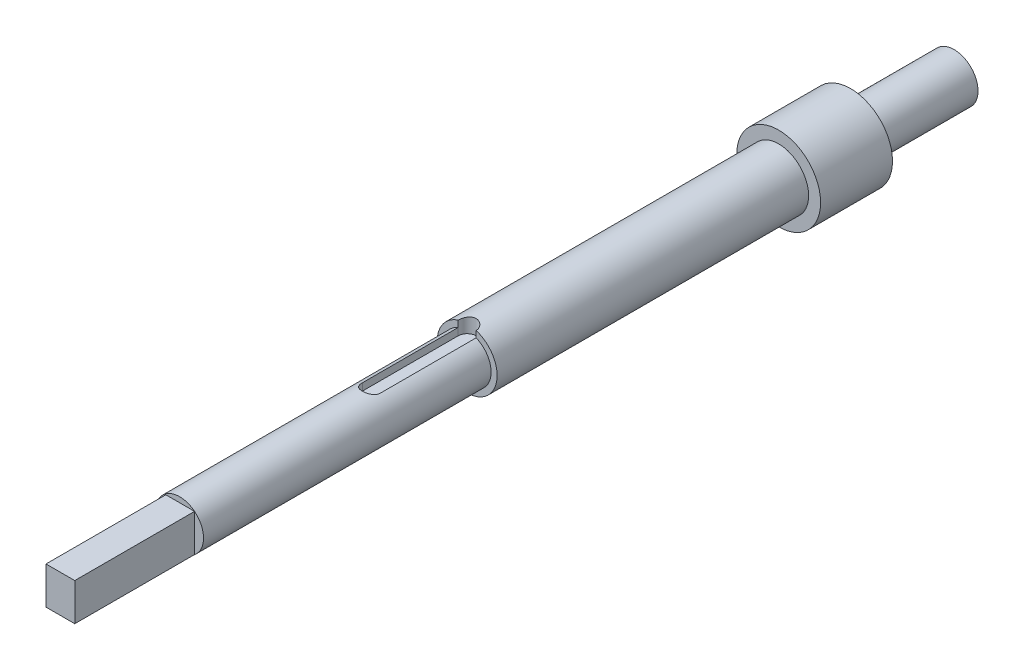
ISO-10303-21;
HEADER;
FILE_DESCRIPTION(('STEP AP214'),'2;1');
FILE_NAME('part.step','',(''),(''),'','','');
FILE_SCHEMA(('AUTOMOTIVE_DESIGN { 1 0 10303 214 1 1 1 1 }'));
ENDSEC;
DATA;
#1=APPLICATION_CONTEXT('core data for automotive mechanical design processes');
#2=APPLICATION_PROTOCOL_DEFINITION('international standard','automotive_design',2000,#1);
#3=PRODUCT_CONTEXT('',#1,'mechanical');
#4=PRODUCT('Part','Part','',(#3));
#5=PRODUCT_RELATED_PRODUCT_CATEGORY('part','',(#4));
#6=PRODUCT_DEFINITION_FORMATION('','',#4);
#7=PRODUCT_DEFINITION_CONTEXT('part definition',#1,'design');
#8=PRODUCT_DEFINITION('design','',#6,#7);
#9=PRODUCT_DEFINITION_SHAPE('','',#8);
#10=(LENGTH_UNIT() NAMED_UNIT(*) SI_UNIT(.MILLI.,.METRE.));
#11=(NAMED_UNIT(*) PLANE_ANGLE_UNIT() SI_UNIT($,.RADIAN.));
#12=(NAMED_UNIT(*) SI_UNIT($,.STERADIAN.) SOLID_ANGLE_UNIT());
#13=UNCERTAINTY_MEASURE_WITH_UNIT(LENGTH_MEASURE(1.E-05),#10,'distance_accuracy_value','');
#14=(GEOMETRIC_REPRESENTATION_CONTEXT(3) GLOBAL_UNCERTAINTY_ASSIGNED_CONTEXT((#13)) GLOBAL_UNIT_ASSIGNED_CONTEXT((#10,
#11,#12)) REPRESENTATION_CONTEXT('',''));
#15=CARTESIAN_POINT('',(0.,0.,0.));
#16=DIRECTION('',(0.,0.,1.));
#17=DIRECTION('',(1.,0.,0.));
#18=AXIS2_PLACEMENT_3D('',#15,#16,#17);
#19=CARTESIAN_POINT('',(0.,0.,76.2));
#20=DIRECTION('',(0.,0.,-1.));
#21=DIRECTION('',(-1.,0.,0.));
#22=AXIS2_PLACEMENT_3D('',#19,#20,#21);
#23=CYLINDRICAL_SURFACE('',#22,6.35);
#24=CARTESIAN_POINT('',(0.,0.,76.2));
#25=DIRECTION('',(0.,0.,1.));
#26=DIRECTION('',(1.,0.,0.));
#27=AXIS2_PLACEMENT_3D('',#24,#25,#26);
#28=CIRCLE('',#27,6.35);
#29=CARTESIAN_POINT('',(3.96875,4.95696716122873,76.2));
#30=VERTEX_POINT('',#29);
#31=CARTESIAN_POINT('',(3.96875,-4.95696716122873,76.2));
#32=VERTEX_POINT('',#31);
#33=EDGE_CURVE('E213',#30,#32,#28,.T.);
#34=ORIENTED_EDGE('',*,*,#33,.F.);
#35=EDGE_CURVE('E224',#32,#30,#28,.T.);
#36=ORIENTED_EDGE('',*,*,#35,.F.);
#37=EDGE_LOOP('',(#34,#36));
#38=FACE_BOUND('',#37,.T.);
#39=DIRECTION('',(0.,0.,-1.));
#40=VECTOR('',#39,1.);
#41=CARTESIAN_POINT('',(-2.38124999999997,5.88660754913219,76.2));
#42=LINE('',#41,#40);
#43=CARTESIAN_POINT('',(-2.38125,5.88660754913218,0.));
#44=VERTEX_POINT('',#43);
#45=CARTESIAN_POINT('',(-2.38125,5.88660754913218,25.4));
#46=VERTEX_POINT('',#45);
#47=EDGE_CURVE('E144',#44,#46,#42,.F.);
#48=ORIENTED_EDGE('',*,*,#47,.F.);
#49=CARTESIAN_POINT('',(0.,0.,0.));
#50=DIRECTION('',(0.,0.,-1.));
#51=DIRECTION('',(-1.,0.,0.));
#52=AXIS2_PLACEMENT_3D('',#49,#50,#51);
#53=CIRCLE('',#52,6.35);
#54=CARTESIAN_POINT('',(2.38125,5.88660754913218,0.));
#55=VERTEX_POINT('',#54);
#56=EDGE_CURVE('E219',#55,#44,#53,.T.);
#57=ORIENTED_EDGE('',*,*,#56,.F.);
#58=DIRECTION('',(0.,0.,-1.));
#59=VECTOR('',#58,1.);
#60=CARTESIAN_POINT('',(2.38124999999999,5.88660754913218,76.2));
#61=LINE('',#60,#59);
#62=CARTESIAN_POINT('',(2.38125,5.88660754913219,25.4));
#63=VERTEX_POINT('',#62);
#64=EDGE_CURVE('E115',#63,#55,#61,.T.);
#65=ORIENTED_EDGE('',*,*,#64,.F.);
#66=CARTESIAN_POINT('',(-2.38125,5.88660754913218,25.4));
#67=CARTESIAN_POINT('',(-2.38125913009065,5.88659548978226,25.4644226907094));
#68=CARTESIAN_POINT('',(-2.37863587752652,5.88766481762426,25.528838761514));
#69=CARTESIAN_POINT('',(-2.36819587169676,5.89187627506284,25.6571594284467));
#70=CARTESIAN_POINT('',(-2.36038086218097,5.89501770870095,25.7210641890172));
#71=CARTESIAN_POINT('',(-2.33966527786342,5.90326887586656,25.8476832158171));
#72=CARTESIAN_POINT('',(-2.32678281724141,5.90837159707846,25.9104008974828));
#73=CARTESIAN_POINT('',(-2.29607189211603,5.92037365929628,26.0344224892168));
#74=CARTESIAN_POINT('',(-2.27824317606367,5.92727309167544,26.0957263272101));
#75=CARTESIAN_POINT('',(-2.21760056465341,5.95034770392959,26.276786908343));
#76=CARTESIAN_POINT('',(-2.16759271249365,5.96891509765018,26.3939186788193));
#77=CARTESIAN_POINT('',(-2.04999893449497,6.01031361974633,26.618167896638));
#78=CARTESIAN_POINT('',(-1.9823986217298,6.03314823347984,26.725277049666));
#79=CARTESIAN_POINT('',(-1.82795372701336,6.08176928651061,26.9317585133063));
#80=CARTESIAN_POINT('',(-1.74038090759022,6.10764225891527,27.0305669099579));
#81=CARTESIAN_POINT('',(-1.55002603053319,6.15870284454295,27.2124881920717));
#82=CARTESIAN_POINT('',(-1.44724103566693,6.1838903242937,27.2955980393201));
#83=CARTESIAN_POINT('',(-1.22506388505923,6.23177717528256,27.4465095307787));
#84=CARTESIAN_POINT('',(-1.10522541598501,6.25436262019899,27.5136935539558));
#85=CARTESIAN_POINT('',(-0.854953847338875,6.2934538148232,27.6267100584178));
#86=CARTESIAN_POINT('',(-0.72452471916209,6.30996183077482,27.6725505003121));
#87=CARTESIAN_POINT('',(-0.462740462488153,6.33442171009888,27.7395903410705));
#88=CARTESIAN_POINT('',(-0.33166788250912,6.34271188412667,27.7617672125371));
#89=CARTESIAN_POINT('',(-0.0674145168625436,6.35101622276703,27.7839824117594));
#90=CARTESIAN_POINT('',(0.0657656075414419,6.35103293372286,27.7840275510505));
#91=CARTESIAN_POINT('',(0.323443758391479,6.34300331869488,27.762546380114));
#92=CARTESIAN_POINT('',(0.448045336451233,6.33535587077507,27.7420872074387));
#93=CARTESIAN_POINT('',(0.691896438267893,6.31338053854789,27.681973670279));
#94=CARTESIAN_POINT('',(0.81114565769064,6.29905227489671,27.6423182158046));
#95=CARTESIAN_POINT('',(1.04296990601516,6.26487460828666,27.5444420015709));
#96=CARTESIAN_POINT('',(1.15542250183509,6.24494786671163,27.4859593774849));
#97=CARTESIAN_POINT('',(1.36919723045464,6.2015896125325,27.3523201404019));
#98=CARTESIAN_POINT('',(1.47051572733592,6.1781569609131,27.2771581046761));
#99=CARTESIAN_POINT('',(1.66542402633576,6.12858570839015,27.1071607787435));
#100=CARTESIAN_POINT('',(1.75821624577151,6.102368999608,27.0114325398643));
#101=CARTESIAN_POINT('',(1.92674438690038,6.05127511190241,26.8055976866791));
#102=CARTESIAN_POINT('',(2.00247360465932,6.02639846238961,26.6954854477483));
#103=CARTESIAN_POINT('',(2.1362669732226,5.98030090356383,26.460834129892));
#104=CARTESIAN_POINT('',(2.1938910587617,5.95917580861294,26.3360242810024));
#105=CARTESIAN_POINT('',(2.28693844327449,5.92409675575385,26.0775349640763));
#106=CARTESIAN_POINT('',(2.32239905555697,5.91013075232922,25.943870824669));
#107=CARTESIAN_POINT('',(2.35774344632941,5.89607385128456,25.7407076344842));
#108=CARTESIAN_POINT('',(2.36655020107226,5.89253768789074,25.6728875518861));
#109=CARTESIAN_POINT('',(2.37830215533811,5.88780085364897,25.5367249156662));
#110=CARTESIAN_POINT('',(2.38125280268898,5.88659801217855,25.4683829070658));
#111=CARTESIAN_POINT('',(2.38124999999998,5.88660754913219,25.4));
#112=B_SPLINE_CURVE_WITH_KNOTS('',3,(#66,#67,#68,#69,#70,#71,#72,#73,#74,#75,#76,#77,#78,#79,
#80,#81,#82,#83,#84,#85,#86,#87,#88,#89,#90,#91,#92,#93,#94,#95,#96,#97,#98,#99,#100,#101,#102,
#103,#104,#105,#106,#107,#108,#109,#110,#111),.UNSPECIFIED.,.F.,.F.,(4,2,2,2,2,2,2,2,2,2,2,2,2,
2,2,2,2,2,2,2,2,2,4),(0.,0.193194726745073,0.386324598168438,0.578770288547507,
0.771225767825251,1.15545658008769,1.54000260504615,1.94182796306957,2.34373100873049,
2.75931921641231,3.17475229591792,3.57226821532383,3.96966179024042,4.34739430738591,
4.72514827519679,5.10840147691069,5.49177946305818,5.89755993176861,6.30349955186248,
6.71865488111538,7.13310937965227,7.33829571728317,7.54329108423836),.UNSPECIFIED.);
#113=EDGE_CURVE('E11',#46,#63,#112,.T.);
#114=ORIENTED_EDGE('',*,*,#113,.F.);
#115=EDGE_LOOP('',(#48,#57,#65,#114));
#116=FACE_BOUND('',#115,.T.);
#117=ADVANCED_FACE('F33',(#38,#116),#23,.T.);
#118=CARTESIAN_POINT('',(0.,0.,-82.55));
#119=DIRECTION('',(0.,0.,1.));
#120=DIRECTION('',(1.,0.,0.));
#121=AXIS2_PLACEMENT_3D('',#118,#119,#120);
#122=CYLINDRICAL_SURFACE('',#121,7.9375);
#123=CARTESIAN_POINT('',(0.,0.,-82.55));
#124=DIRECTION('',(0.,0.,-1.));
#125=DIRECTION('',(-1.,0.,0.));
#126=AXIS2_PLACEMENT_3D('',#123,#124,#125);
#127=CIRCLE('',#126,7.9375);
#128=CARTESIAN_POINT('',(-7.9375,0.,-82.55));
#129=VERTEX_POINT('',#128);
#130=EDGE_CURVE('E225',#129,#129,#127,.T.);
#131=ORIENTED_EDGE('',*,*,#130,.F.);
#132=EDGE_LOOP('',(#131));
#133=FACE_BOUND('',#132,.T.);
#134=CARTESIAN_POINT('',(2.38124999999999,7.57189241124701,0.));
#135=CARTESIAN_POINT('',(2.38125815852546,7.57188330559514,-0.0653538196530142));
#136=CARTESIAN_POINT('',(2.37855968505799,7.57273831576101,-0.130702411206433));
#137=CARTESIAN_POINT('',(2.36781294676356,7.57610889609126,-0.260900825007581));
#138=CARTESIAN_POINT('',(2.3597658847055,7.57862409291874,-0.325750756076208));
#139=CARTESIAN_POINT('',(2.33841242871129,7.58523905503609,-0.454330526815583));
#140=CARTESIAN_POINT('',(2.32511938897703,7.58933479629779,-0.518062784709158));
#141=CARTESIAN_POINT('',(2.29340452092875,7.59897853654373,-0.644108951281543));
#142=CARTESIAN_POINT('',(2.27498255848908,7.60452657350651,-0.706422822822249));
#143=CARTESIAN_POINT('',(2.21224938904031,7.62310862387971,-0.890547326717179));
#144=CARTESIAN_POINT('',(2.16044345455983,7.63808962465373,-1.00970432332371));
#145=CARTESIAN_POINT('',(2.03846940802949,7.67153988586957,-1.23763567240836));
#146=CARTESIAN_POINT('',(1.96829275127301,7.69001076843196,-1.34640516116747));
#147=CARTESIAN_POINT('',(1.80919341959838,7.72901085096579,-1.55394262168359));
#148=CARTESIAN_POINT('',(1.719793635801,7.74958369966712,-1.65233736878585));
#149=CARTESIAN_POINT('',(1.52580765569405,7.79009767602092,-1.83298593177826));
#150=CARTESIAN_POINT('',(1.42121889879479,7.81003869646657,-1.91523702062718));
#151=CARTESIAN_POINT('',(1.19714960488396,7.84754016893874,-2.06289819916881));
#152=CARTESIAN_POINT('',(1.07740582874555,7.86504286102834,-2.12792483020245));
#153=CARTESIAN_POINT('',(0.828073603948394,7.89518471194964,-2.23676924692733));
#154=CARTESIAN_POINT('',(0.698487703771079,7.9078251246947,-2.28059250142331));
#155=CARTESIAN_POINT('',(0.437077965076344,7.92650878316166,-2.34454664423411));
#156=CARTESIAN_POINT('',(0.305424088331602,7.93273034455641,-2.36531920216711));
#157=CARTESIAN_POINT('',(0.0403599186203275,7.93850333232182,-2.38461128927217));
#158=CARTESIAN_POINT('',(-0.0930500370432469,7.93805602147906,-2.3831350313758));
#159=CARTESIAN_POINT('',(-0.35333241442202,7.93066744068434,-2.35840125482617));
#160=CARTESIAN_POINT('',(-0.480277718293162,7.92393347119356,-2.33583901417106));
#161=CARTESIAN_POINT('',(-0.728487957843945,7.90498028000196,-2.27070977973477));
#162=CARTESIAN_POINT('',(-0.84975259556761,7.89276077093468,-2.22814173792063));
#163=CARTESIAN_POINT('',(-1.08481465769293,7.86392278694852,-2.12373809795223));
#164=CARTESIAN_POINT('',(-1.19850853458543,7.84725468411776,-2.06168363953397));
#165=CARTESIAN_POINT('',(-1.41409027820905,7.81128779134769,-1.92024223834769));
#166=CARTESIAN_POINT('',(-1.51597549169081,7.79198841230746,-1.84085141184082));
#167=CARTESIAN_POINT('',(-1.70918902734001,7.75194781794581,-1.66339521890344));
#168=CARTESIAN_POINT('',(-1.79996070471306,7.73117969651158,-1.56472911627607));
#169=CARTESIAN_POINT('',(-1.96384496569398,7.69118691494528,-1.35334784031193));
#170=CARTESIAN_POINT('',(-2.03695239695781,7.67196270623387,-1.24062858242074));
#171=CARTESIAN_POINT('',(-2.16402296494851,7.63710100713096,-1.00285402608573));
#172=CARTESIAN_POINT('',(-2.21778522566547,7.62150171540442,-0.877685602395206));
#173=CARTESIAN_POINT('',(-2.30323844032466,7.59611866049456,-0.61956234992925));
#174=CARTESIAN_POINT('',(-2.33496315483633,7.58632600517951,-0.486619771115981));
#175=CARTESIAN_POINT('',(-2.36380660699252,7.57736026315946,-0.293695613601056));
#176=CARTESIAN_POINT('',(-2.37034709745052,7.57531435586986,-0.235123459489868));
#177=CARTESIAN_POINT('',(-2.37906489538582,7.57258024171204,-0.117710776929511));
#178=CARTESIAN_POINT('',(-2.38124861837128,7.57189003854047,-0.0588707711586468));
#179=CARTESIAN_POINT('',(-2.38125000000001,7.571892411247,0.));
#180=B_SPLINE_CURVE_WITH_KNOTS('',3,(#134,#135,#136,#137,#138,#139,#140,#141,#142,#143,#144,
#145,#146,#147,#148,#149,#150,#151,#152,#153,#154,#155,#156,#157,#158,#159,#160,#161,#162,#163,
#164,#165,#166,#167,#168,#169,#170,#171,#172,#173,#174,#175,#176,#177,#178,#179),.UNSPECIFIED.,
.F.,.F.,(4,2,2,2,2,2,2,2,2,2,2,2,2,2,2,2,2,2,2,2,2,2,4),(0.,0.195991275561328,0.391938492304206,
0.587390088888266,0.782846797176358,1.17326844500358,1.56387201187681,1.96560376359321,
2.36740331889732,2.77751230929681,3.1875154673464,3.58579420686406,3.98399753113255,
4.36951721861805,4.7550571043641,5.14509213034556,5.53521462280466,5.94033955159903,
6.34558250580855,6.7549196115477,7.16362823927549,7.34039575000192,7.51690277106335),.UNSPECIFIED.);
#181=CARTESIAN_POINT('',(2.38125,7.57189241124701,0.));
#182=VERTEX_POINT('',#181);
#183=CARTESIAN_POINT('',(-2.38125,7.57189241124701,0.));
#184=VERTEX_POINT('',#183);
#185=EDGE_CURVE('E146',#182,#184,#180,.T.);
#186=ORIENTED_EDGE('',*,*,#185,.F.);
#187=CARTESIAN_POINT('',(0.,0.,0.));
#188=DIRECTION('',(0.,0.,-1.));
#189=DIRECTION('',(-1.,0.,0.));
#190=AXIS2_PLACEMENT_3D('',#187,#188,#189);
#191=CIRCLE('',#190,7.9375);
#192=EDGE_CURVE('E230',#182,#184,#191,.T.);
#193=ORIENTED_EDGE('',*,*,#192,.T.);
#194=EDGE_LOOP('',(#186,#193));
#195=FACE_BOUND('',#194,.T.);
#196=ADVANCED_FACE('F156',(#133,#195),#122,.T.);
#197=CARTESIAN_POINT('',(0.,0.,0.));
#198=DIRECTION('',(0.,0.,-1.));
#199=DIRECTION('',(-1.,0.,0.));
#200=AXIS2_PLACEMENT_3D('',#197,#198,#199);
#201=PLANE('',#200);
#202=DIRECTION('',(0.,-1.,0.));
#203=VECTOR('',#202,1.);
#204=CARTESIAN_POINT('',(-2.38125,0.,0.));
#205=LINE('',#204,#203);
#206=EDGE_CURVE('E45',#184,#44,#205,.T.);
#207=ORIENTED_EDGE('',*,*,#206,.F.);
#208=ORIENTED_EDGE('',*,*,#192,.F.);
#209=DIRECTION('',(0.,1.,0.));
#210=VECTOR('',#209,1.);
#211=CARTESIAN_POINT('',(2.38125,0.,0.));
#212=LINE('',#211,#210);
#213=EDGE_CURVE('E223',#55,#182,#212,.T.);
#214=ORIENTED_EDGE('',*,*,#213,.F.);
#215=ORIENTED_EDGE('',*,*,#56,.T.);
#216=EDGE_LOOP('',(#207,#208,#214,#215));
#217=FACE_BOUND('',#216,.T.);
#218=ADVANCED_FACE('F196',(#217),#201,.F.);
#219=CARTESIAN_POINT('',(0.,0.,76.2));
#220=DIRECTION('',(0.,0.,1.));
#221=DIRECTION('',(1.,0.,0.));
#222=AXIS2_PLACEMENT_3D('',#219,#220,#221);
#223=PLANE('',#222);
#224=DIRECTION('',(0.,1.,0.));
#225=VECTOR('',#224,1.);
#226=CARTESIAN_POINT('',(3.96875,4.95696716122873,76.2));
#227=LINE('',#226,#225);
#228=EDGE_CURVE('E153',#32,#30,#227,.T.);
#229=ORIENTED_EDGE('',*,*,#228,.F.);
#230=ORIENTED_EDGE('',*,*,#35,.T.);
#231=EDGE_LOOP('',(#229,#230));
#232=FACE_BOUND('',#231,.T.);
#233=ADVANCED_FACE('F198',(#232),#223,.T.);
#234=DIRECTION('',(1.,0.,0.));
#235=VECTOR('',#234,1.);
#236=CARTESIAN_POINT('',(-3.65125,-4.95696716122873,76.2));
#237=LINE('',#236,#235);
#238=CARTESIAN_POINT('',(-3.65125,-4.95696716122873,76.2));
#239=VERTEX_POINT('',#238);
#240=EDGE_CURVE('E60',#239,#32,#237,.T.);
#241=ORIENTED_EDGE('',*,*,#240,.F.);
#242=DIRECTION('',(0.,-1.,0.));
#243=VECTOR('',#242,1.);
#244=CARTESIAN_POINT('',(-3.65125,4.95696716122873,76.2));
#245=LINE('',#244,#243);
#246=CARTESIAN_POINT('',(-3.65125,4.95696716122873,76.2));
#247=VERTEX_POINT('',#246);
#248=EDGE_CURVE('E258',#247,#239,#245,.T.);
#249=ORIENTED_EDGE('',*,*,#248,.F.);
#250=DIRECTION('',(-1.,0.,0.));
#251=VECTOR('',#250,1.);
#252=CARTESIAN_POINT('',(-3.65125,4.95696716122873,76.2));
#253=LINE('',#252,#251);
#254=EDGE_CURVE('E260',#30,#247,#253,.T.);
#255=ORIENTED_EDGE('',*,*,#254,.F.);
#256=ORIENTED_EDGE('',*,*,#33,.T.);
#257=EDGE_LOOP('',(#241,#249,#255,#256));
#258=FACE_BOUND('',#257,.T.);
#259=ADVANCED_FACE('F194',(#258),#223,.T.);
#260=CARTESIAN_POINT('',(0.,0.,-101.6));
#261=DIRECTION('',(0.,0.,1.));
#262=DIRECTION('',(1.,0.,0.));
#263=AXIS2_PLACEMENT_3D('',#260,#261,#262);
#264=CYLINDRICAL_SURFACE('',#263,11.1125);
#265=CARTESIAN_POINT('',(0.,0.,-101.6));
#266=DIRECTION('',(0.,0.,-1.));
#267=DIRECTION('',(-1.,0.,0.));
#268=AXIS2_PLACEMENT_3D('',#265,#266,#267);
#269=CIRCLE('',#268,11.1125);
#270=CARTESIAN_POINT('',(11.1125,0.,-101.6));
#271=VERTEX_POINT('',#270);
#272=EDGE_CURVE('E236',#271,#271,#269,.T.);
#273=CARTESIAN_POINT('',(0.,0.,-82.55));
#274=DIRECTION('',(0.,0.,-1.));
#275=DIRECTION('',(-1.,0.,0.));
#276=AXIS2_PLACEMENT_3D('',#273,#274,#275);
#277=CIRCLE('',#276,11.1125);
#278=CARTESIAN_POINT('',(11.1125,0.,-82.55));
#279=VERTEX_POINT('',#278);
#280=EDGE_CURVE('E238',#279,#279,#277,.T.);
#281=CARTESIAN_POINT('',(11.1125,0.,-101.6));
#282=CARTESIAN_POINT('',(11.1125,0.,-101.4015625));
#283=CARTESIAN_POINT('',(11.1125,0.,-101.203125));
#284=CARTESIAN_POINT('',(11.1125,0.,-100.80625));
#285=CARTESIAN_POINT('',(11.1125,0.,-100.6078125));
#286=CARTESIAN_POINT('',(11.1125,0.,-100.2109375));
#287=CARTESIAN_POINT('',(11.1125,0.,-100.0125));
#288=CARTESIAN_POINT('',(11.1125,0.,-99.615625));
#289=CARTESIAN_POINT('',(11.1125,0.,-99.4171875));
#290=CARTESIAN_POINT('',(11.1125,0.,-99.0203125));
#291=CARTESIAN_POINT('',(11.1125,0.,-98.821875));
#292=CARTESIAN_POINT('',(11.1125,0.,-98.425));
#293=CARTESIAN_POINT('',(11.1125,0.,-98.2265625));
#294=CARTESIAN_POINT('',(11.1125,0.,-97.8296875));
#295=CARTESIAN_POINT('',(11.1125,0.,-97.63125));
#296=CARTESIAN_POINT('',(11.1125,0.,-97.234375));
#297=CARTESIAN_POINT('',(11.1125,0.,-97.0359375));
#298=CARTESIAN_POINT('',(11.1125,0.,-96.6390625));
#299=CARTESIAN_POINT('',(11.1125,0.,-96.440625));
#300=CARTESIAN_POINT('',(11.1125,0.,-96.04375));
#301=CARTESIAN_POINT('',(11.1125,0.,-95.8453125));
#302=CARTESIAN_POINT('',(11.1125,0.,-95.4484375));
#303=CARTESIAN_POINT('',(11.1125,0.,-95.25));
#304=CARTESIAN_POINT('',(11.1125,0.,-94.853125));
#305=CARTESIAN_POINT('',(11.1125,0.,-94.6546875));
#306=CARTESIAN_POINT('',(11.1125,0.,-94.2578125));
#307=CARTESIAN_POINT('',(11.1125,0.,-94.059375));
#308=CARTESIAN_POINT('',(11.1125,0.,-93.6625));
#309=CARTESIAN_POINT('',(11.1125,0.,-93.4640625));
#310=CARTESIAN_POINT('',(11.1125,0.,-93.0671875));
#311=CARTESIAN_POINT('',(11.1125,0.,-92.86875));
#312=CARTESIAN_POINT('',(11.1125,0.,-92.471875));
#313=CARTESIAN_POINT('',(11.1125,0.,-92.2734375));
#314=CARTESIAN_POINT('',(11.1125,0.,-91.8765625));
#315=CARTESIAN_POINT('',(11.1125,0.,-91.678125));
#316=CARTESIAN_POINT('',(11.1125,0.,-91.28125));
#317=CARTESIAN_POINT('',(11.1125,0.,-91.0828125));
#318=CARTESIAN_POINT('',(11.1125,0.,-90.6859375));
#319=CARTESIAN_POINT('',(11.1125,0.,-90.4875));
#320=CARTESIAN_POINT('',(11.1125,0.,-90.090625));
#321=CARTESIAN_POINT('',(11.1125,0.,-89.8921875));
#322=CARTESIAN_POINT('',(11.1125,0.,-89.4953125));
#323=CARTESIAN_POINT('',(11.1125,0.,-89.296875));
#324=CARTESIAN_POINT('',(11.1125,0.,-88.9));
#325=CARTESIAN_POINT('',(11.1125,0.,-88.7015625));
#326=CARTESIAN_POINT('',(11.1125,0.,-88.3046875));
#327=CARTESIAN_POINT('',(11.1125,0.,-88.10625));
#328=CARTESIAN_POINT('',(11.1125,0.,-87.709375));
#329=CARTESIAN_POINT('',(11.1125,0.,-87.5109375));
#330=CARTESIAN_POINT('',(11.1125,0.,-87.1140625));
#331=CARTESIAN_POINT('',(11.1125,0.,-86.915625));
#332=CARTESIAN_POINT('',(11.1125,0.,-86.51875));
#333=CARTESIAN_POINT('',(11.1125,0.,-86.3203125));
#334=CARTESIAN_POINT('',(11.1125,0.,-85.9234375));
#335=CARTESIAN_POINT('',(11.1125,0.,-85.725));
#336=CARTESIAN_POINT('',(11.1125,0.,-85.328125));
#337=CARTESIAN_POINT('',(11.1125,0.,-85.1296875));
#338=CARTESIAN_POINT('',(11.1125,0.,-84.7328125));
#339=CARTESIAN_POINT('',(11.1125,0.,-84.534375));
#340=CARTESIAN_POINT('',(11.1125,0.,-84.1375));
#341=CARTESIAN_POINT('',(11.1125,0.,-83.9390625));
#342=CARTESIAN_POINT('',(11.1125,0.,-83.5421875));
#343=CARTESIAN_POINT('',(11.1125,0.,-83.34375));
#344=CARTESIAN_POINT('',(11.1125,0.,-82.946875));
#345=CARTESIAN_POINT('',(11.1125,0.,-82.7484375));
#346=CARTESIAN_POINT('',(11.1125,0.,-82.55));
#347=B_SPLINE_CURVE_WITH_KNOTS('',3,(#281,#282,#283,#284,#285,#286,#287,#288,#289,#290,#291,
#292,#293,#294,#295,#296,#297,#298,#299,#300,#301,#302,#303,#304,#305,#306,#307,#308,#309,#310,
#311,#312,#313,#314,#315,#316,#317,#318,#319,#320,#321,#322,#323,#324,#325,#326,#327,#328,#329,
#330,#331,#332,#333,#334,#335,#336,#337,#338,#339,#340,#341,#342,#343,#344,#345,#346),
.UNSPECIFIED.,.F.,.F.,(4,2,2,2,2,2,2,2,2,2,2,2,2,2,2,2,2,2,2,2,2,2,2,2,2,2,2,2,2,2,2,2,4),(0.,
0.5953125,1.190625,1.7859375,2.38125,2.9765625,3.571875,4.1671875,4.7625,5.3578125,5.953125,
6.5484375,7.14375,7.7390625,8.334375,8.92968750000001,9.52500000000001,10.1203125,10.715625,
11.3109375,11.90625,12.5015625,13.096875,13.6921875,14.2875,14.8828125,15.478125,16.0734375,
16.66875,17.2640625,17.859375,18.4546875,19.05),.UNSPECIFIED.);
#348=EDGE_CURVE('BSEAM188',#271,#279,#347,.T.);
#349=ORIENTED_EDGE('',*,*,#272,.F.);
#350=ORIENTED_EDGE('',*,*,#280,.T.);
#351=ORIENTED_EDGE('',*,*,#348,.T.);
#352=ORIENTED_EDGE('',*,*,#348,.F.);
#353=EDGE_LOOP('',(#349,#351,#350,#352));
#354=FACE_BOUND('',#353,.T.);
#355=ADVANCED_FACE('F188',(#354),#264,.T.);
#356=CARTESIAN_POINT('',(0.,0.,-101.6));
#357=DIRECTION('',(0.,0.,-1.));
#358=DIRECTION('',(-1.,0.,0.));
#359=AXIS2_PLACEMENT_3D('',#356,#357,#358);
#360=PLANE('',#359);
#361=CARTESIAN_POINT('',(0.,0.,-101.6));
#362=DIRECTION('',(0.,0.,-1.));
#363=DIRECTION('',(-1.,0.,0.));
#364=AXIS2_PLACEMENT_3D('',#361,#362,#363);
#365=CIRCLE('',#364,6.35);
#366=CARTESIAN_POINT('',(-6.35,0.,-101.6));
#367=VERTEX_POINT('',#366);
#368=EDGE_CURVE('E133',#367,#367,#365,.T.);
#369=ORIENTED_EDGE('',*,*,#368,.F.);
#370=EDGE_LOOP('',(#369));
#371=FACE_BOUND('',#370,.T.);
#372=ORIENTED_EDGE('',*,*,#272,.T.);
#373=EDGE_LOOP('',(#372));
#374=FACE_BOUND('',#373,.T.);
#375=ADVANCED_FACE('F185',(#371,#374),#360,.T.);
#376=CARTESIAN_POINT('',(0.,0.,-82.55));
#377=DIRECTION('',(0.,0.,-1.));
#378=DIRECTION('',(-1.,0.,0.));
#379=AXIS2_PLACEMENT_3D('',#376,#377,#378);
#380=PLANE('',#379);
#381=ORIENTED_EDGE('',*,*,#130,.T.);
#382=EDGE_LOOP('',(#381));
#383=FACE_BOUND('',#382,.T.);
#384=ORIENTED_EDGE('',*,*,#280,.F.);
#385=EDGE_LOOP('',(#384));
#386=FACE_BOUND('',#385,.T.);
#387=ADVANCED_FACE('F183',(#383,#386),#380,.F.);
#388=CARTESIAN_POINT('',(3.96875,4.95696716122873,107.95));
#389=DIRECTION('',(-1.,0.,0.));
#390=DIRECTION('',(0.,0.,1.));
#391=AXIS2_PLACEMENT_3D('',#388,#389,#390);
#392=PLANE('',#391);
#393=ORIENTED_EDGE('',*,*,#228,.T.);
#394=DIRECTION('',(0.,0.,-1.));
#395=VECTOR('',#394,1.);
#396=CARTESIAN_POINT('',(3.96875,4.95696716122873,107.95));
#397=LINE('',#396,#395);
#398=CARTESIAN_POINT('',(3.96875,4.95696716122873,107.95));
#399=VERTEX_POINT('',#398);
#400=EDGE_CURVE('E243',#399,#30,#397,.T.);
#401=ORIENTED_EDGE('',*,*,#400,.F.);
#402=DIRECTION('',(0.,1.,0.));
#403=VECTOR('',#402,1.);
#404=CARTESIAN_POINT('',(3.96875,4.95696716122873,107.95));
#405=LINE('',#404,#403);
#406=CARTESIAN_POINT('',(3.96875,-4.95696716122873,107.95));
#407=VERTEX_POINT('',#406);
#408=EDGE_CURVE('E154',#407,#399,#405,.T.);
#409=ORIENTED_EDGE('',*,*,#408,.F.);
#410=DIRECTION('',(0.,0.,-1.));
#411=VECTOR('',#410,1.);
#412=CARTESIAN_POINT('',(3.96875,-4.95696716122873,107.95));
#413=LINE('',#412,#411);
#414=EDGE_CURVE('E253',#407,#32,#413,.T.);
#415=ORIENTED_EDGE('',*,*,#414,.T.);
#416=EDGE_LOOP('',(#393,#401,#409,#415));
#417=FACE_BOUND('',#416,.T.);
#418=ADVANCED_FACE('F179',(#417),#392,.F.);
#419=CARTESIAN_POINT('',(-3.65125,4.95696716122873,107.95));
#420=DIRECTION('',(0.,-1.,0.));
#421=DIRECTION('',(0.,0.,-1.));
#422=AXIS2_PLACEMENT_3D('',#419,#420,#421);
#423=PLANE('',#422);
#424=ORIENTED_EDGE('',*,*,#254,.T.);
#425=DIRECTION('',(0.,0.,-1.));
#426=VECTOR('',#425,1.);
#427=CARTESIAN_POINT('',(-3.65125,4.95696716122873,107.95));
#428=LINE('',#427,#426);
#429=CARTESIAN_POINT('',(-3.65125,4.95696716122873,107.95));
#430=VERTEX_POINT('',#429);
#431=EDGE_CURVE('E247',#430,#247,#428,.T.);
#432=ORIENTED_EDGE('',*,*,#431,.F.);
#433=DIRECTION('',(-1.,0.,0.));
#434=VECTOR('',#433,1.);
#435=CARTESIAN_POINT('',(-3.65125,4.95696716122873,107.95));
#436=LINE('',#435,#434);
#437=EDGE_CURVE('E267',#399,#430,#436,.T.);
#438=ORIENTED_EDGE('',*,*,#437,.F.);
#439=ORIENTED_EDGE('',*,*,#400,.T.);
#440=EDGE_LOOP('',(#424,#432,#438,#439));
#441=FACE_BOUND('',#440,.T.);
#442=ADVANCED_FACE('F175',(#441),#423,.F.);
#443=CARTESIAN_POINT('',(-3.65125,4.95696716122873,107.95));
#444=DIRECTION('',(1.,0.,0.));
#445=DIRECTION('',(0.,1.,0.));
#446=AXIS2_PLACEMENT_3D('',#443,#444,#445);
#447=PLANE('',#446);
#448=ORIENTED_EDGE('',*,*,#248,.T.);
#449=DIRECTION('',(0.,0.,-1.));
#450=VECTOR('',#449,1.);
#451=CARTESIAN_POINT('',(-3.65125,-4.95696716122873,107.95));
#452=LINE('',#451,#450);
#453=CARTESIAN_POINT('',(-3.65125,-4.95696716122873,107.95));
#454=VERTEX_POINT('',#453);
#455=EDGE_CURVE('E250',#454,#239,#452,.T.);
#456=ORIENTED_EDGE('',*,*,#455,.F.);
#457=DIRECTION('',(0.,-1.,0.));
#458=VECTOR('',#457,1.);
#459=CARTESIAN_POINT('',(-3.65125,4.95696716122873,107.95));
#460=LINE('',#459,#458);
#461=EDGE_CURVE('E266',#430,#454,#460,.T.);
#462=ORIENTED_EDGE('',*,*,#461,.F.);
#463=ORIENTED_EDGE('',*,*,#431,.T.);
#464=EDGE_LOOP('',(#448,#456,#462,#463));
#465=FACE_BOUND('',#464,.T.);
#466=ADVANCED_FACE('F171',(#465),#447,.F.);
#467=CARTESIAN_POINT('',(-3.65125,-4.95696716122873,107.95));
#468=DIRECTION('',(0.,1.,0.));
#469=DIRECTION('',(0.,0.,1.));
#470=AXIS2_PLACEMENT_3D('',#467,#468,#469);
#471=PLANE('',#470);
#472=ORIENTED_EDGE('',*,*,#240,.T.);
#473=ORIENTED_EDGE('',*,*,#414,.F.);
#474=DIRECTION('',(1.,0.,0.));
#475=VECTOR('',#474,1.);
#476=CARTESIAN_POINT('',(-3.65125,-4.95696716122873,107.95));
#477=LINE('',#476,#475);
#478=EDGE_CURVE('E256',#454,#407,#477,.T.);
#479=ORIENTED_EDGE('',*,*,#478,.F.);
#480=ORIENTED_EDGE('',*,*,#455,.T.);
#481=EDGE_LOOP('',(#472,#473,#479,#480));
#482=FACE_BOUND('',#481,.T.);
#483=ADVANCED_FACE('F167',(#482),#471,.F.);
#484=CARTESIAN_POINT('',(0.,0.,107.95));
#485=DIRECTION('',(0.,0.,1.));
#486=DIRECTION('',(1.,0.,0.));
#487=AXIS2_PLACEMENT_3D('',#484,#485,#486);
#488=PLANE('',#487);
#489=ORIENTED_EDGE('',*,*,#408,.T.);
#490=ORIENTED_EDGE('',*,*,#437,.T.);
#491=ORIENTED_EDGE('',*,*,#461,.T.);
#492=ORIENTED_EDGE('',*,*,#478,.T.);
#493=EDGE_LOOP('',(#489,#490,#491,#492));
#494=FACE_BOUND('',#493,.T.);
#495=ADVANCED_FACE('F164',(#494),#488,.T.);
#496=CARTESIAN_POINT('',(0.,11.1125,25.4));
#497=DIRECTION('',(0.,-1.,0.));
#498=DIRECTION('',(0.,0.,-1.));
#499=AXIS2_PLACEMENT_3D('',#496,#497,#498);
#500=CYLINDRICAL_SURFACE('',#499,2.38124999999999);
#501=ORIENTED_EDGE('',*,*,#113,.T.);
#502=DIRECTION('',(0.,-1.,0.));
#503=VECTOR('',#502,1.);
#504=CARTESIAN_POINT('',(2.38125,11.1125,25.4));
#505=LINE('',#504,#503);
#506=CARTESIAN_POINT('',(2.38125,3.96875,25.4));
#507=VERTEX_POINT('',#506);
#508=EDGE_CURVE('E140',#63,#507,#505,.T.);
#509=ORIENTED_EDGE('',*,*,#508,.T.);
#510=CARTESIAN_POINT('',(0.,3.96875,25.4));
#511=DIRECTION('',(0.,1.,0.));
#512=DIRECTION('',(0.,0.,1.));
#513=AXIS2_PLACEMENT_3D('',#510,#511,#512);
#514=CIRCLE('',#513,2.38124999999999);
#515=CARTESIAN_POINT('',(-2.38125,3.96875,25.4));
#516=VERTEX_POINT('',#515);
#517=EDGE_CURVE('E125',#516,#507,#514,.T.);
#518=ORIENTED_EDGE('',*,*,#517,.F.);
#519=DIRECTION('',(0.,-1.,0.));
#520=VECTOR('',#519,1.);
#521=CARTESIAN_POINT('',(-2.38125,11.1125,25.4));
#522=LINE('',#521,#520);
#523=EDGE_CURVE('E116',#46,#516,#522,.T.);
#524=ORIENTED_EDGE('',*,*,#523,.F.);
#525=EDGE_LOOP('',(#501,#509,#518,#524));
#526=FACE_BOUND('',#525,.T.);
#527=ADVANCED_FACE('F163',(#526),#500,.F.);
#528=CARTESIAN_POINT('',(0.,11.1125,0.));
#529=DIRECTION('',(0.,-1.,0.));
#530=DIRECTION('',(0.,0.,-1.));
#531=AXIS2_PLACEMENT_3D('',#528,#529,#530);
#532=CYLINDRICAL_SURFACE('',#531,2.38125);
#533=ORIENTED_EDGE('',*,*,#185,.T.);
#534=ORIENTED_EDGE('',*,*,#206,.T.);
#535=DIRECTION('',(0.,-1.,0.));
#536=VECTOR('',#535,1.);
#537=CARTESIAN_POINT('',(-2.38125,11.1125,0.));
#538=LINE('',#537,#536);
#539=CARTESIAN_POINT('',(-2.38125,3.96875,0.));
#540=VERTEX_POINT('',#539);
#541=EDGE_CURVE('E106',#44,#540,#538,.T.);
#542=ORIENTED_EDGE('',*,*,#541,.T.);
#543=CARTESIAN_POINT('',(0.,3.96875,0.));
#544=DIRECTION('',(0.,1.,0.));
#545=DIRECTION('',(0.,0.,1.));
#546=AXIS2_PLACEMENT_3D('',#543,#544,#545);
#547=CIRCLE('',#546,2.38125);
#548=CARTESIAN_POINT('',(2.38125,3.96875,0.));
#549=VERTEX_POINT('',#548);
#550=EDGE_CURVE('E110',#549,#540,#547,.T.);
#551=ORIENTED_EDGE('',*,*,#550,.F.);
#552=DIRECTION('',(0.,-1.,0.));
#553=VECTOR('',#552,1.);
#554=CARTESIAN_POINT('',(2.38125,11.1125,0.));
#555=LINE('',#554,#553);
#556=EDGE_CURVE('E52',#55,#549,#555,.T.);
#557=ORIENTED_EDGE('',*,*,#556,.F.);
#558=ORIENTED_EDGE('',*,*,#213,.T.);
#559=EDGE_LOOP('',(#533,#534,#542,#551,#557,#558));
#560=FACE_BOUND('',#559,.T.);
#561=ADVANCED_FACE('F108',(#560),#532,.F.);
#562=CARTESIAN_POINT('',(-2.38125,11.1125,0.));
#563=DIRECTION('',(1.,0.,0.));
#564=DIRECTION('',(0.,0.,-1.));
#565=AXIS2_PLACEMENT_3D('',#562,#563,#564);
#566=PLANE('',#565);
#567=ORIENTED_EDGE('',*,*,#47,.T.);
#568=ORIENTED_EDGE('',*,*,#523,.T.);
#569=DIRECTION('',(0.,0.,1.));
#570=VECTOR('',#569,1.);
#571=CARTESIAN_POINT('',(-2.38125,3.96875,0.));
#572=LINE('',#571,#570);
#573=EDGE_CURVE('E119',#540,#516,#572,.T.);
#574=ORIENTED_EDGE('',*,*,#573,.F.);
#575=ORIENTED_EDGE('',*,*,#541,.F.);
#576=EDGE_LOOP('',(#567,#568,#574,#575));
#577=FACE_BOUND('',#576,.T.);
#578=ADVANCED_FACE('F120',(#577),#566,.T.);
#579=CARTESIAN_POINT('',(2.38125,11.1125,0.));
#580=DIRECTION('',(-1.,0.,0.));
#581=DIRECTION('',(0.,0.,1.));
#582=AXIS2_PLACEMENT_3D('',#579,#580,#581);
#583=PLANE('',#582);
#584=ORIENTED_EDGE('',*,*,#64,.T.);
#585=ORIENTED_EDGE('',*,*,#556,.T.);
#586=DIRECTION('',(0.,0.,-1.));
#587=VECTOR('',#586,1.);
#588=CARTESIAN_POINT('',(2.38125,3.96875,0.));
#589=LINE('',#588,#587);
#590=EDGE_CURVE('E129',#507,#549,#589,.T.);
#591=ORIENTED_EDGE('',*,*,#590,.F.);
#592=ORIENTED_EDGE('',*,*,#508,.F.);
#593=EDGE_LOOP('',(#584,#585,#591,#592));
#594=FACE_BOUND('',#593,.T.);
#595=ADVANCED_FACE('F331',(#594),#583,.T.);
#596=CARTESIAN_POINT('',(0.,3.96875,0.));
#597=DIRECTION('',(0.,1.,0.));
#598=DIRECTION('',(0.,0.,1.));
#599=AXIS2_PLACEMENT_3D('',#596,#597,#598);
#600=PLANE('',#599);
#601=ORIENTED_EDGE('',*,*,#550,.T.);
#602=ORIENTED_EDGE('',*,*,#573,.T.);
#603=ORIENTED_EDGE('',*,*,#517,.T.);
#604=ORIENTED_EDGE('',*,*,#590,.T.);
#605=EDGE_LOOP('',(#601,#602,#603,#604));
#606=FACE_BOUND('',#605,.T.);
#607=ADVANCED_FACE('F127',(#606),#600,.T.);
#608=CARTESIAN_POINT('',(0.,0.,-129.032));
#609=DIRECTION('',(0.,0.,1.));
#610=DIRECTION('',(1.,0.,0.));
#611=AXIS2_PLACEMENT_3D('',#608,#609,#610);
#612=CYLINDRICAL_SURFACE('',#611,6.35);
#613=CARTESIAN_POINT('',(0.,0.,-129.032));
#614=DIRECTION('',(0.,0.,-1.));
#615=DIRECTION('',(-1.,0.,0.));
#616=AXIS2_PLACEMENT_3D('',#613,#614,#615);
#617=CIRCLE('',#616,6.35);
#618=CARTESIAN_POINT('',(-6.35,0.,-129.032));
#619=VERTEX_POINT('',#618);
#620=EDGE_CURVE('E130',#619,#619,#617,.T.);
#621=ORIENTED_EDGE('',*,*,#620,.F.);
#622=EDGE_LOOP('',(#621));
#623=FACE_BOUND('',#622,.T.);
#624=ORIENTED_EDGE('',*,*,#368,.T.);
#625=EDGE_LOOP('',(#624));
#626=FACE_BOUND('',#625,.T.);
#627=ADVANCED_FACE('F343',(#623,#626),#612,.T.);
#628=CARTESIAN_POINT('',(0.,0.,-129.032));
#629=DIRECTION('',(0.,0.,-1.));
#630=DIRECTION('',(-1.,0.,0.));
#631=AXIS2_PLACEMENT_3D('',#628,#629,#630);
#632=PLANE('',#631);
#633=ORIENTED_EDGE('',*,*,#620,.T.);
#634=EDGE_LOOP('',(#633));
#635=FACE_BOUND('',#634,.T.);
#636=ADVANCED_FACE('F349',(#635),#632,.T.);
#637=CLOSED_SHELL('',(#117,#196,#218,#233,#259,#355,#375,#387,#418,#442,#466,#483,#495,#527,
#561,#578,#595,#607,#627,#636));
#638=MANIFOLD_SOLID_BREP('B2',#637);
#639=ADVANCED_BREP_SHAPE_REPRESENTATION('',(#18,#638),#14);
#640=SHAPE_DEFINITION_REPRESENTATION(#9,#639);
ENDSEC;
END-ISO-10303-21;
